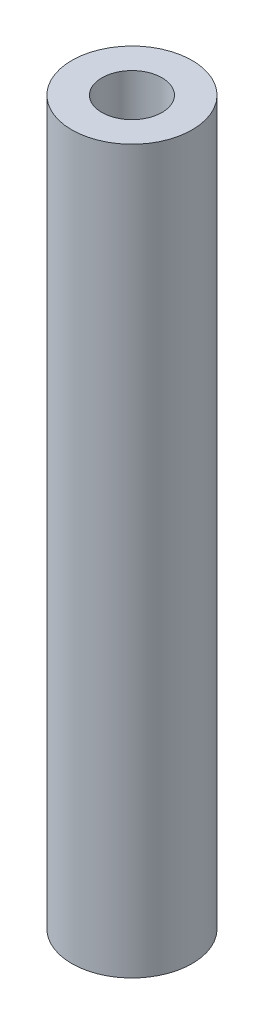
from build123d import *

# Parameters (mm, degrees)
SZKIC1_R                    = 5
SZKIC1_R_2                  = 2.5
DODANIE_WYCI_GNI_CIE1_DEPTH = 60


with BuildPart() as part:
    # Szkic1 → Dodanie-wyci_gni_cie1 (new body)
    with BuildSketch(Plane(origin=(0, 0, 0), x_dir=(1, 0, 0), z_dir=(0, 1, 0))):
        with Locations(Location((0, 0, 0), (0, 0, 270))):
            Circle(SZKIC1_R)
        with Locations(Location((0, 0, 0), (0, 0, 270))):
            Circle(SZKIC1_R_2, mode=Mode.SUBTRACT)
    extrude(amount=DODANIE_WYCI_GNI_CIE1_DEPTH)


solid = part.part
